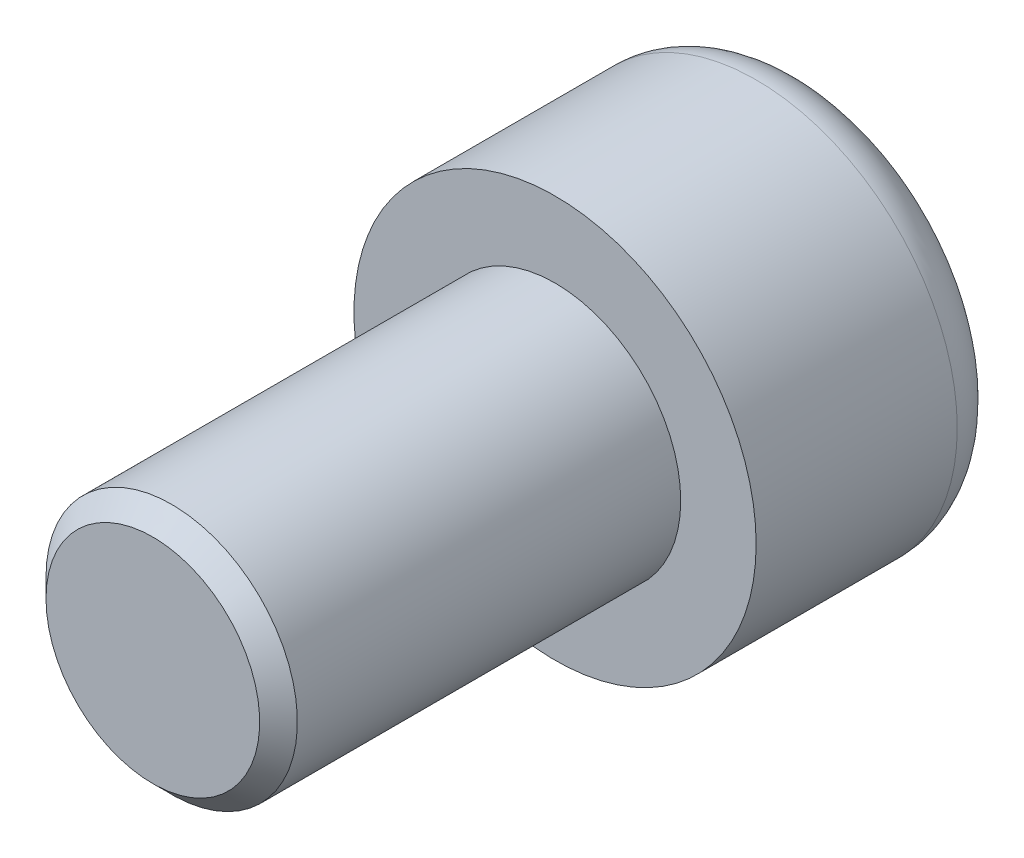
from build123d import *

# Parameters (mm, degrees)
PROFIL_T_TE_R         = 8
TETE_DEPTH            = 10
SIX_PANS_DEPTH        = 6.25
CONGE_R               = 2
PROFIL_CYLINDRE_R     = 5
CYLINDRE_FILETE_DEPTH = 16


with BuildPart() as part:
    # profil t_te → TETE (new body)
    with BuildSketch(Plane.XY):
        Circle(PROFIL_T_TE_R)
    extrude(amount=TETE_DEPTH)

    # profil six pans → SIX PANS (cut)
    with BuildSketch(Plane(origin=(0, 0, 0), x_dir=(-1, 0, 0), z_dir=(0, 0, -1))):
        Polygon((0, 4.618802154), (-4, 2.309401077), (-4, -2.309401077), (0, -4.618802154), (4, -2.309401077), (4, 2.309401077), align=None)
    extrude(amount=-SIX_PANS_DEPTH, mode=Mode.SUBTRACT)

    # CONGE
    conge_edges = [part.edges().sort_by_distance(p)[0] for p in [
        (-8, 0, 0),
    ]]
    fillet(conge_edges, radius=CONGE_R)

    # profil cylindre → CYLINDRE FILETE (add)
    with BuildSketch(Plane.XY.offset(10)):
        Circle(PROFIL_CYLINDRE_R)
    extrude(amount=CYLINDRE_FILETE_DEPTH)

    # profil chanfrein → CHANFREIN FILET (revolve, cut)
    with BuildSketch(Plane(origin=(0, 0, 0), x_dir=(0, 0, -1), z_dir=(1, 0, 0)), mode=Mode.PRIVATE) as chanfrein_filet_sk:
        Polygon((-26, 4.25), (-25.25, 5), (-26, 5), align=None)
    revolve(chanfrein_filet_sk.sketch.rotate(Axis((0, 0, 12.087417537), (0, 0, 1)), 90), axis=Axis((0, 0, 12.087417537), (0, 0, 1)), mode=Mode.SUBTRACT)


solid = part.part
